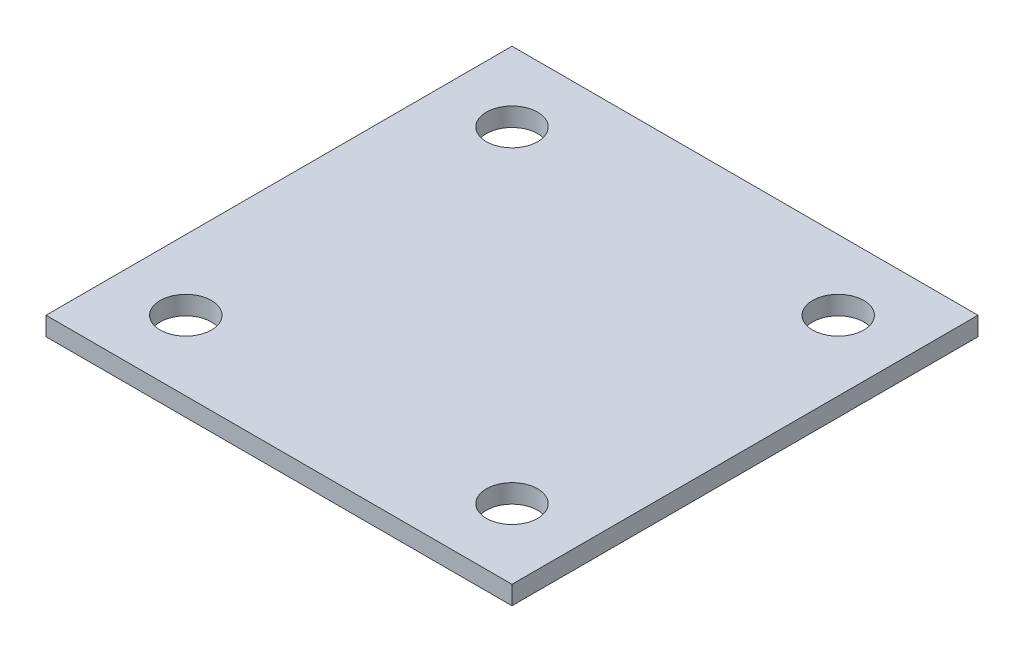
ISO-10303-21;
HEADER;
FILE_DESCRIPTION(('STEP AP214'),'2;1');
FILE_NAME('part.step','',(''),(''),'','','');
FILE_SCHEMA(('AUTOMOTIVE_DESIGN { 1 0 10303 214 1 1 1 1 }'));
ENDSEC;
DATA;
#1=APPLICATION_CONTEXT('core data for automotive mechanical design processes');
#2=APPLICATION_PROTOCOL_DEFINITION('international standard','automotive_design',2000,#1);
#3=PRODUCT_CONTEXT('',#1,'mechanical');
#4=PRODUCT('Part','Part','',(#3));
#5=PRODUCT_RELATED_PRODUCT_CATEGORY('part','',(#4));
#6=PRODUCT_DEFINITION_FORMATION('','',#4);
#7=PRODUCT_DEFINITION_CONTEXT('part definition',#1,'design');
#8=PRODUCT_DEFINITION('design','',#6,#7);
#9=PRODUCT_DEFINITION_SHAPE('','',#8);
#10=(LENGTH_UNIT() NAMED_UNIT(*) SI_UNIT(.MILLI.,.METRE.));
#11=(NAMED_UNIT(*) PLANE_ANGLE_UNIT() SI_UNIT($,.RADIAN.));
#12=(NAMED_UNIT(*) SI_UNIT($,.STERADIAN.) SOLID_ANGLE_UNIT());
#13=UNCERTAINTY_MEASURE_WITH_UNIT(LENGTH_MEASURE(1.E-05),#10,'distance_accuracy_value','');
#14=(GEOMETRIC_REPRESENTATION_CONTEXT(3) GLOBAL_UNCERTAINTY_ASSIGNED_CONTEXT((#13)) GLOBAL_UNIT_ASSIGNED_CONTEXT((#10,
#11,#12)) REPRESENTATION_CONTEXT('',''));
#15=CARTESIAN_POINT('',(0.,0.,0.));
#16=DIRECTION('',(0.,0.,1.));
#17=DIRECTION('',(1.,0.,0.));
#18=AXIS2_PLACEMENT_3D('',#15,#16,#17);
#19=CARTESIAN_POINT('',(0.,4.,0.));
#20=DIRECTION('',(0.,-1.,0.));
#21=DIRECTION('',(0.,0.,-1.));
#22=AXIS2_PLACEMENT_3D('',#19,#20,#21);
#23=PLANE('',#22);
#24=DIRECTION('',(0.,0.,1.));
#25=VECTOR('',#24,1.);
#26=CARTESIAN_POINT('',(-50.,4.,50.));
#27=LINE('',#26,#25);
#28=CARTESIAN_POINT('',(-50.,4.,-50.));
#29=VERTEX_POINT('',#28);
#30=CARTESIAN_POINT('',(-50.,4.,50.));
#31=VERTEX_POINT('',#30);
#32=EDGE_CURVE('E93',#29,#31,#27,.T.);
#33=ORIENTED_EDGE('',*,*,#32,.T.);
#34=DIRECTION('',(1.,0.,0.));
#35=VECTOR('',#34,1.);
#36=CARTESIAN_POINT('',(-50.,4.,50.));
#37=LINE('',#36,#35);
#38=CARTESIAN_POINT('',(50.,4.,50.));
#39=VERTEX_POINT('',#38);
#40=EDGE_CURVE('E88',#31,#39,#37,.T.);
#41=ORIENTED_EDGE('',*,*,#40,.T.);
#42=DIRECTION('',(0.,0.,-1.));
#43=VECTOR('',#42,1.);
#44=CARTESIAN_POINT('',(50.,4.,50.));
#45=LINE('',#44,#43);
#46=CARTESIAN_POINT('',(50.,4.,-50.));
#47=VERTEX_POINT('',#46);
#48=EDGE_CURVE('E90',#39,#47,#45,.T.);
#49=ORIENTED_EDGE('',*,*,#48,.T.);
#50=DIRECTION('',(-1.,0.,0.));
#51=VECTOR('',#50,1.);
#52=CARTESIAN_POINT('',(-50.,4.,-50.));
#53=LINE('',#52,#51);
#54=EDGE_CURVE('E57',#47,#29,#53,.T.);
#55=ORIENTED_EDGE('',*,*,#54,.T.);
#56=EDGE_LOOP('',(#33,#41,#49,#55));
#57=FACE_BOUND('',#56,.T.);
#58=CARTESIAN_POINT('',(-35.,4.,35.));
#59=DIRECTION('',(0.,1.,0.));
#60=DIRECTION('',(0.,0.,1.));
#61=AXIS2_PLACEMENT_3D('',#58,#59,#60);
#62=CIRCLE('',#61,5.5);
#63=CARTESIAN_POINT('',(-35.,4.,40.5));
#64=VERTEX_POINT('',#63);
#65=EDGE_CURVE('E106',#64,#64,#62,.T.);
#66=ORIENTED_EDGE('',*,*,#65,.F.);
#67=EDGE_LOOP('',(#66));
#68=FACE_BOUND('',#67,.T.);
#69=CARTESIAN_POINT('',(-35.,4.,-35.));
#70=DIRECTION('',(0.,1.,0.));
#71=DIRECTION('',(0.,0.,1.));
#72=AXIS2_PLACEMENT_3D('',#69,#70,#71);
#73=CIRCLE('',#72,5.5);
#74=CARTESIAN_POINT('',(-35.,4.,-29.5));
#75=VERTEX_POINT('',#74);
#76=EDGE_CURVE('E123',#75,#75,#73,.T.);
#77=ORIENTED_EDGE('',*,*,#76,.F.);
#78=EDGE_LOOP('',(#77));
#79=FACE_BOUND('',#78,.T.);
#80=CARTESIAN_POINT('',(35.,4.,35.));
#81=DIRECTION('',(0.,1.,0.));
#82=DIRECTION('',(0.,0.,1.));
#83=AXIS2_PLACEMENT_3D('',#80,#81,#82);
#84=CIRCLE('',#83,5.5);
#85=CARTESIAN_POINT('',(35.,4.,40.5));
#86=VERTEX_POINT('',#85);
#87=EDGE_CURVE('E130',#86,#86,#84,.T.);
#88=ORIENTED_EDGE('',*,*,#87,.F.);
#89=EDGE_LOOP('',(#88));
#90=FACE_BOUND('',#89,.T.);
#91=CARTESIAN_POINT('',(35.,4.,-35.));
#92=DIRECTION('',(0.,1.,0.));
#93=DIRECTION('',(0.,0.,1.));
#94=AXIS2_PLACEMENT_3D('',#91,#92,#93);
#95=CIRCLE('',#94,5.5);
#96=CARTESIAN_POINT('',(35.,4.,-29.5));
#97=VERTEX_POINT('',#96);
#98=EDGE_CURVE('E135',#97,#97,#95,.T.);
#99=ORIENTED_EDGE('',*,*,#98,.F.);
#100=EDGE_LOOP('',(#99));
#101=FACE_BOUND('',#100,.T.);
#102=ADVANCED_FACE('F39',(#57,#68,#79,#90,#101),#23,.F.);
#103=CARTESIAN_POINT('',(0.,0.,0.));
#104=DIRECTION('',(0.,-1.,0.));
#105=DIRECTION('',(0.,0.,-1.));
#106=AXIS2_PLACEMENT_3D('',#103,#104,#105);
#107=PLANE('',#106);
#108=CARTESIAN_POINT('',(35.,0.,35.));
#109=DIRECTION('',(0.,1.,0.));
#110=DIRECTION('',(0.,0.,1.));
#111=AXIS2_PLACEMENT_3D('',#108,#109,#110);
#112=CIRCLE('',#111,5.5);
#113=CARTESIAN_POINT('',(35.,0.,40.5));
#114=VERTEX_POINT('',#113);
#115=EDGE_CURVE('E128',#114,#114,#112,.T.);
#116=ORIENTED_EDGE('',*,*,#115,.T.);
#117=EDGE_LOOP('',(#116));
#118=FACE_BOUND('',#117,.T.);
#119=CARTESIAN_POINT('',(-35.,0.,35.));
#120=DIRECTION('',(0.,1.,0.));
#121=DIRECTION('',(0.,0.,1.));
#122=AXIS2_PLACEMENT_3D('',#119,#120,#121);
#123=CIRCLE('',#122,5.5);
#124=CARTESIAN_POINT('',(-35.,0.,40.5));
#125=VERTEX_POINT('',#124);
#126=EDGE_CURVE('E120',#125,#125,#123,.T.);
#127=ORIENTED_EDGE('',*,*,#126,.T.);
#128=EDGE_LOOP('',(#127));
#129=FACE_BOUND('',#128,.T.);
#130=DIRECTION('',(0.,0.,1.));
#131=VECTOR('',#130,1.);
#132=CARTESIAN_POINT('',(-50.,0.,50.));
#133=LINE('',#132,#131);
#134=CARTESIAN_POINT('',(-50.,0.,-50.));
#135=VERTEX_POINT('',#134);
#136=CARTESIAN_POINT('',(-50.,0.,50.));
#137=VERTEX_POINT('',#136);
#138=EDGE_CURVE('E103',#135,#137,#133,.T.);
#139=ORIENTED_EDGE('',*,*,#138,.F.);
#140=DIRECTION('',(-1.,0.,0.));
#141=VECTOR('',#140,1.);
#142=CARTESIAN_POINT('',(-50.,0.,-50.));
#143=LINE('',#142,#141);
#144=CARTESIAN_POINT('',(50.,0.,-50.));
#145=VERTEX_POINT('',#144);
#146=EDGE_CURVE('E76',#145,#135,#143,.T.);
#147=ORIENTED_EDGE('',*,*,#146,.F.);
#148=DIRECTION('',(0.,0.,-1.));
#149=VECTOR('',#148,1.);
#150=CARTESIAN_POINT('',(50.,0.,50.));
#151=LINE('',#150,#149);
#152=CARTESIAN_POINT('',(50.,0.,50.));
#153=VERTEX_POINT('',#152);
#154=EDGE_CURVE('E71',#153,#145,#151,.T.);
#155=ORIENTED_EDGE('',*,*,#154,.F.);
#156=DIRECTION('',(1.,0.,0.));
#157=VECTOR('',#156,1.);
#158=CARTESIAN_POINT('',(-50.,0.,50.));
#159=LINE('',#158,#157);
#160=EDGE_CURVE('E92',#137,#153,#159,.T.);
#161=ORIENTED_EDGE('',*,*,#160,.F.);
#162=EDGE_LOOP('',(#139,#147,#155,#161));
#163=FACE_BOUND('',#162,.T.);
#164=CARTESIAN_POINT('',(-35.,0.,-35.));
#165=DIRECTION('',(0.,1.,0.));
#166=DIRECTION('',(0.,0.,1.));
#167=AXIS2_PLACEMENT_3D('',#164,#165,#166);
#168=CIRCLE('',#167,5.5);
#169=CARTESIAN_POINT('',(-35.,0.,-29.5));
#170=VERTEX_POINT('',#169);
#171=EDGE_CURVE('E124',#170,#170,#168,.T.);
#172=ORIENTED_EDGE('',*,*,#171,.T.);
#173=EDGE_LOOP('',(#172));
#174=FACE_BOUND('',#173,.T.);
#175=CARTESIAN_POINT('',(35.,0.,-35.));
#176=DIRECTION('',(0.,1.,0.));
#177=DIRECTION('',(0.,0.,1.));
#178=AXIS2_PLACEMENT_3D('',#175,#176,#177);
#179=CIRCLE('',#178,5.5);
#180=CARTESIAN_POINT('',(35.,0.,-29.5));
#181=VERTEX_POINT('',#180);
#182=EDGE_CURVE('E138',#181,#181,#179,.T.);
#183=ORIENTED_EDGE('',*,*,#182,.T.);
#184=EDGE_LOOP('',(#183));
#185=FACE_BOUND('',#184,.T.);
#186=ADVANCED_FACE('F111',(#118,#129,#163,#174,#185),#107,.T.);
#187=CARTESIAN_POINT('',(-50.,4.,50.));
#188=DIRECTION('',(1.,0.,0.));
#189=DIRECTION('',(0.,0.,-1.));
#190=AXIS2_PLACEMENT_3D('',#187,#188,#189);
#191=PLANE('',#190);
#192=ORIENTED_EDGE('',*,*,#138,.T.);
#193=DIRECTION('',(0.,-1.,0.));
#194=VECTOR('',#193,1.);
#195=CARTESIAN_POINT('',(-50.,4.,50.));
#196=LINE('',#195,#194);
#197=EDGE_CURVE('E11',#31,#137,#196,.T.);
#198=ORIENTED_EDGE('',*,*,#197,.F.);
#199=ORIENTED_EDGE('',*,*,#32,.F.);
#200=DIRECTION('',(0.,-1.,0.));
#201=VECTOR('',#200,1.);
#202=CARTESIAN_POINT('',(-50.,4.,-50.));
#203=LINE('',#202,#201);
#204=EDGE_CURVE('E97',#29,#135,#203,.T.);
#205=ORIENTED_EDGE('',*,*,#204,.T.);
#206=EDGE_LOOP('',(#192,#198,#199,#205));
#207=FACE_BOUND('',#206,.T.);
#208=ADVANCED_FACE('F41',(#207),#191,.F.);
#209=CARTESIAN_POINT('',(-50.,4.,50.));
#210=DIRECTION('',(0.,0.,-1.));
#211=DIRECTION('',(-1.,0.,0.));
#212=AXIS2_PLACEMENT_3D('',#209,#210,#211);
#213=PLANE('',#212);
#214=ORIENTED_EDGE('',*,*,#160,.T.);
#215=DIRECTION('',(0.,-1.,0.));
#216=VECTOR('',#215,1.);
#217=CARTESIAN_POINT('',(50.,4.,50.));
#218=LINE('',#217,#216);
#219=EDGE_CURVE('E48',#39,#153,#218,.T.);
#220=ORIENTED_EDGE('',*,*,#219,.F.);
#221=ORIENTED_EDGE('',*,*,#40,.F.);
#222=ORIENTED_EDGE('',*,*,#197,.T.);
#223=EDGE_LOOP('',(#214,#220,#221,#222));
#224=FACE_BOUND('',#223,.T.);
#225=ADVANCED_FACE('F94',(#224),#213,.F.);
#226=CARTESIAN_POINT('',(50.,4.,50.));
#227=DIRECTION('',(-1.,0.,0.));
#228=DIRECTION('',(0.,0.,1.));
#229=AXIS2_PLACEMENT_3D('',#226,#227,#228);
#230=PLANE('',#229);
#231=ORIENTED_EDGE('',*,*,#154,.T.);
#232=DIRECTION('',(0.,-1.,0.));
#233=VECTOR('',#232,1.);
#234=CARTESIAN_POINT('',(50.,4.,-50.));
#235=LINE('',#234,#233);
#236=EDGE_CURVE('E96',#47,#145,#235,.T.);
#237=ORIENTED_EDGE('',*,*,#236,.F.);
#238=ORIENTED_EDGE('',*,*,#48,.F.);
#239=ORIENTED_EDGE('',*,*,#219,.T.);
#240=EDGE_LOOP('',(#231,#237,#238,#239));
#241=FACE_BOUND('',#240,.T.);
#242=ADVANCED_FACE('F100',(#241),#230,.F.);
#243=CARTESIAN_POINT('',(-50.,4.,-50.));
#244=DIRECTION('',(0.,0.,1.));
#245=DIRECTION('',(1.,0.,0.));
#246=AXIS2_PLACEMENT_3D('',#243,#244,#245);
#247=PLANE('',#246);
#248=ORIENTED_EDGE('',*,*,#146,.T.);
#249=ORIENTED_EDGE('',*,*,#204,.F.);
#250=ORIENTED_EDGE('',*,*,#54,.F.);
#251=ORIENTED_EDGE('',*,*,#236,.T.);
#252=EDGE_LOOP('',(#248,#249,#250,#251));
#253=FACE_BOUND('',#252,.T.);
#254=ADVANCED_FACE('F112',(#253),#247,.F.);
#255=CARTESIAN_POINT('',(-35.,4.,35.));
#256=DIRECTION('',(0.,-1.,0.));
#257=DIRECTION('',(0.,0.,-1.));
#258=AXIS2_PLACEMENT_3D('',#255,#256,#257);
#259=CYLINDRICAL_SURFACE('',#258,5.5);
#260=ORIENTED_EDGE('',*,*,#65,.T.);
#261=EDGE_LOOP('',(#260));
#262=FACE_BOUND('',#261,.T.);
#263=ORIENTED_EDGE('',*,*,#126,.F.);
#264=EDGE_LOOP('',(#263));
#265=FACE_BOUND('',#264,.T.);
#266=ADVANCED_FACE('F153',(#262,#265),#259,.F.);
#267=CARTESIAN_POINT('',(-35.,4.,-35.));
#268=DIRECTION('',(0.,-1.,0.));
#269=DIRECTION('',(0.,0.,-1.));
#270=AXIS2_PLACEMENT_3D('',#267,#268,#269);
#271=CYLINDRICAL_SURFACE('',#270,5.5);
#272=ORIENTED_EDGE('',*,*,#76,.T.);
#273=EDGE_LOOP('',(#272));
#274=FACE_BOUND('',#273,.T.);
#275=ORIENTED_EDGE('',*,*,#171,.F.);
#276=EDGE_LOOP('',(#275));
#277=FACE_BOUND('',#276,.T.);
#278=ADVANCED_FACE('F196',(#274,#277),#271,.F.);
#279=CARTESIAN_POINT('',(35.,4.,35.));
#280=DIRECTION('',(0.,-1.,0.));
#281=DIRECTION('',(0.,0.,-1.));
#282=AXIS2_PLACEMENT_3D('',#279,#280,#281);
#283=CYLINDRICAL_SURFACE('',#282,5.5);
#284=ORIENTED_EDGE('',*,*,#87,.T.);
#285=EDGE_LOOP('',(#284));
#286=FACE_BOUND('',#285,.T.);
#287=ORIENTED_EDGE('',*,*,#115,.F.);
#288=EDGE_LOOP('',(#287));
#289=FACE_BOUND('',#288,.T.);
#290=ADVANCED_FACE('F206',(#286,#289),#283,.F.);
#291=CARTESIAN_POINT('',(35.,4.,-35.));
#292=DIRECTION('',(0.,-1.,0.));
#293=DIRECTION('',(0.,0.,-1.));
#294=AXIS2_PLACEMENT_3D('',#291,#292,#293);
#295=CYLINDRICAL_SURFACE('',#294,5.5);
#296=ORIENTED_EDGE('',*,*,#98,.T.);
#297=EDGE_LOOP('',(#296));
#298=FACE_BOUND('',#297,.T.);
#299=ORIENTED_EDGE('',*,*,#182,.F.);
#300=EDGE_LOOP('',(#299));
#301=FACE_BOUND('',#300,.T.);
#302=ADVANCED_FACE('F142',(#298,#301),#295,.F.);
#303=CLOSED_SHELL('',(#102,#186,#208,#225,#242,#254,#266,#278,#290,#302));
#304=MANIFOLD_SOLID_BREP('B2',#303);
#305=ADVANCED_BREP_SHAPE_REPRESENTATION('',(#18,#304),#14);
#306=SHAPE_DEFINITION_REPRESENTATION(#9,#305);
ENDSEC;
END-ISO-10303-21;
